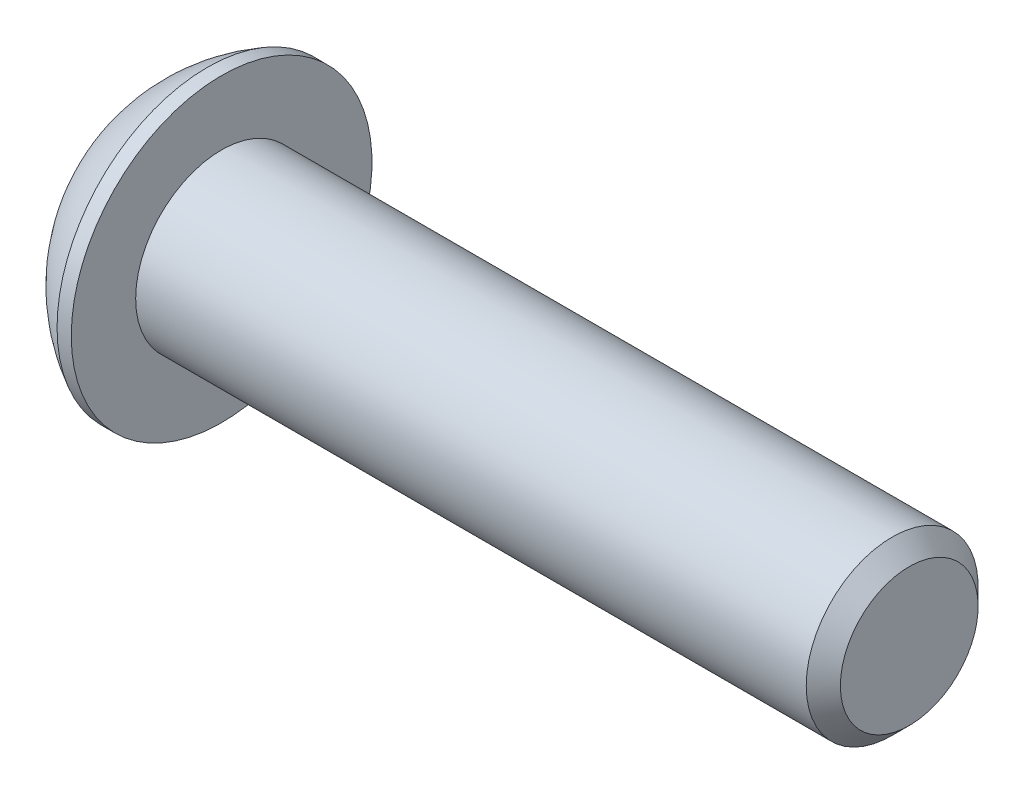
from build123d import *

# Parameters (mm, degrees)
HEX_2_DEPTH = 3.0988


with BuildPart() as part:
    # BodySke → BaseBody (revolve)
    with BuildSketch(Plane.XY, mode=Mode.PRIVATE) as basebody_sk:
        with BuildLine():
            Line((42.9768, 0), (42.9768, 3.81635))
            Line((42.9768, 3.81635), (42.03065, 4.7625))
            Line((42.03065, 4.7625), (4.8768, 4.7625))
            Line((4.8768, 4.7625), (4.8768, 8.3312))
            Line((4.8768, 8.3312), (4.0894, 8.3312))
            ThreePointArc((4.0894, 8.3312), (1.712581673, 6.574442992), (0, 4.1656))
            Line((0, 4.1656), (0, 0))
            Line((0, 0), (42.9768, 0))
        make_face()
    revolve(basebody_sk.sketch.rotate(Axis((0, 0, 0), (1, 0, 0)), 90), axis=Axis((0, 0, 0), (1, 0, 0)))

    # Sketch2 → PreBroach (revolve, cut)
    with BuildSketch(Plane.XY, mode=Mode.PRIVATE) as prebroach_sk:
        Polygon((0, 2.7813), (3.0988, 2.7813), (4.704584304, 0), (0, 0), align=None)
    revolve(prebroach_sk.sketch.rotate(Axis((0, 0, 0), (1, 0, 0)), 90), axis=Axis((0, 0, 0), (1, 0, 0)), mode=Mode.SUBTRACT)

    # Sketch3 → Hex 2 (cut)
    with BuildSketch(Plane(origin=(0, 0, 0), x_dir=(0, 0, -1), z_dir=(1, 0, 0))):
        Polygon((-2.7813, -1.605784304), (-2.7813, 1.605784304), (0, 3.211568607), (2.7813, 1.605784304), (2.7813, -1.605784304), (0, -3.211568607), align=None)
    extrude(amount=HEX_2_DEPTH, mode=Mode.SUBTRACT)


solid = part.part
